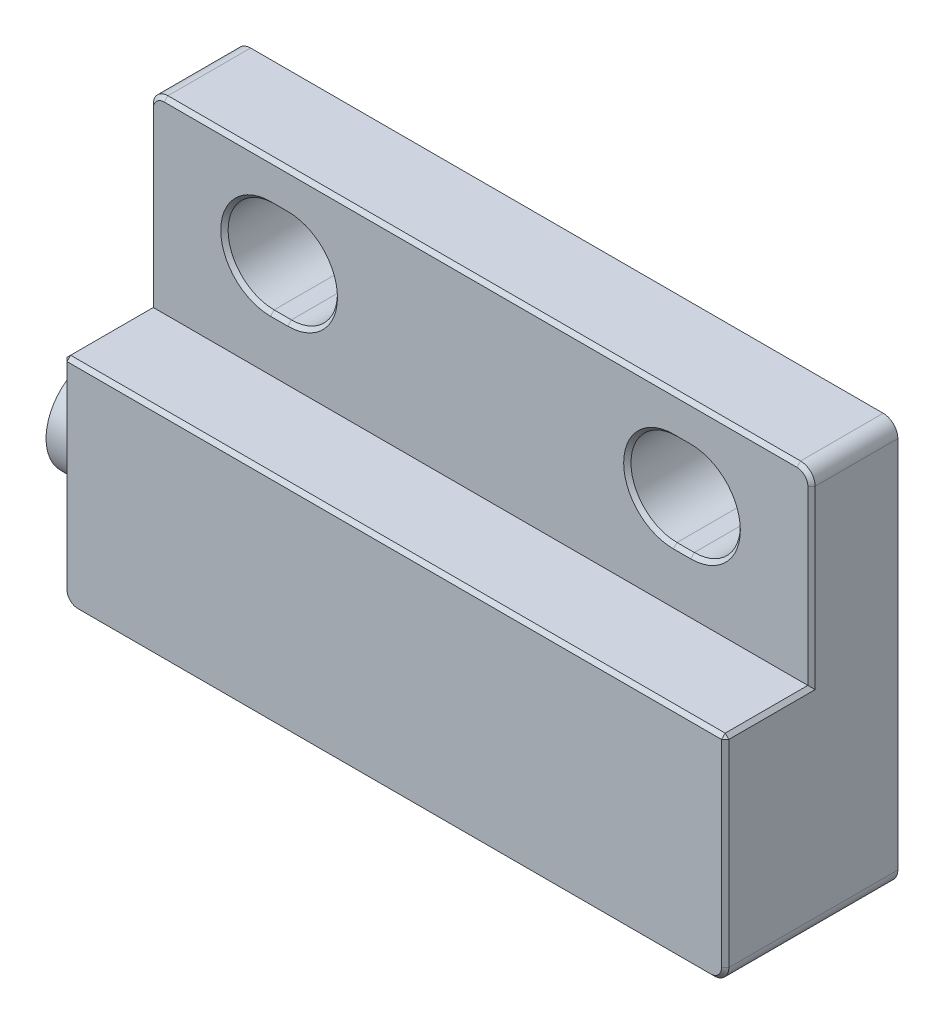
ISO-10303-21;
HEADER;
FILE_DESCRIPTION(('STEP AP214'),'2;1');
FILE_NAME('part.step','',(''),(''),'','','');
FILE_SCHEMA(('AUTOMOTIVE_DESIGN { 1 0 10303 214 1 1 1 1 }'));
ENDSEC;
DATA;
#1=APPLICATION_CONTEXT('core data for automotive mechanical design processes');
#2=APPLICATION_PROTOCOL_DEFINITION('international standard','automotive_design',2000,#1);
#3=PRODUCT_CONTEXT('',#1,'mechanical');
#4=PRODUCT('Part','Part','',(#3));
#5=PRODUCT_RELATED_PRODUCT_CATEGORY('part','',(#4));
#6=PRODUCT_DEFINITION_FORMATION('','',#4);
#7=PRODUCT_DEFINITION_CONTEXT('part definition',#1,'design');
#8=PRODUCT_DEFINITION('design','',#6,#7);
#9=PRODUCT_DEFINITION_SHAPE('','',#8);
#10=(LENGTH_UNIT() NAMED_UNIT(*) SI_UNIT(.MILLI.,.METRE.));
#11=(NAMED_UNIT(*) PLANE_ANGLE_UNIT() SI_UNIT($,.RADIAN.));
#12=(NAMED_UNIT(*) SI_UNIT($,.STERADIAN.) SOLID_ANGLE_UNIT());
#13=UNCERTAINTY_MEASURE_WITH_UNIT(LENGTH_MEASURE(1.E-05),#10,'distance_accuracy_value','');
#14=(GEOMETRIC_REPRESENTATION_CONTEXT(3) GLOBAL_UNCERTAINTY_ASSIGNED_CONTEXT((#13)) GLOBAL_UNIT_ASSIGNED_CONTEXT((#10,
#11,#12)) REPRESENTATION_CONTEXT('',''));
#15=CARTESIAN_POINT('',(0.,0.,0.));
#16=DIRECTION('',(0.,0.,1.));
#17=DIRECTION('',(1.,0.,0.));
#18=AXIS2_PLACEMENT_3D('',#15,#16,#17);
#19=CARTESIAN_POINT('',(0.,29.373,6.));
#20=DIRECTION('',(0.,0.707106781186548,0.707106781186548));
#21=DIRECTION('',(0.,-0.707106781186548,0.707106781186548));
#22=AXIS2_PLACEMENT_3D('',#19,#20,#21);
#23=PLANE('',#22);
#24=DIRECTION('',(0.,-0.707106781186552,0.707106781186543));
#25=VECTOR('',#24,1.);
#26=CARTESIAN_POINT('',(22.873,29.5,5.873));
#27=LINE('',#26,#25);
#28=CARTESIAN_POINT('',(22.873,29.5,5.873));
#29=VERTEX_POINT('',#28);
#30=CARTESIAN_POINT('',(22.873,29.373,6.));
#31=VERTEX_POINT('',#30);
#32=EDGE_CURVE('E519',#29,#31,#27,.T.);
#33=ORIENTED_EDGE('',*,*,#32,.F.);
#34=DIRECTION('',(1.,0.,0.));
#35=VECTOR('',#34,1.);
#36=CARTESIAN_POINT('',(0.,29.5,5.873));
#37=LINE('',#36,#35);
#38=CARTESIAN_POINT('',(0.126999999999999,29.5,5.873));
#39=VERTEX_POINT('',#38);
#40=EDGE_CURVE('E229',#29,#39,#37,.F.);
#41=ORIENTED_EDGE('',*,*,#40,.T.);
#42=DIRECTION('',(0.,0.707106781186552,-0.707106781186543));
#43=VECTOR('',#42,1.);
#44=CARTESIAN_POINT('',(0.126999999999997,29.373,6.));
#45=LINE('',#44,#43);
#46=CARTESIAN_POINT('',(0.126999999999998,29.373,6.));
#47=VERTEX_POINT('',#46);
#48=EDGE_CURVE('E119',#47,#39,#45,.T.);
#49=ORIENTED_EDGE('',*,*,#48,.F.);
#50=DIRECTION('',(1.,0.,0.));
#51=VECTOR('',#50,1.);
#52=CARTESIAN_POINT('',(0.,29.373,6.));
#53=LINE('',#52,#51);
#54=EDGE_CURVE('E226',#31,#47,#53,.F.);
#55=ORIENTED_EDGE('',*,*,#54,.F.);
#56=EDGE_LOOP('',(#33,#41,#49,#55));
#57=FACE_BOUND('',#56,.T.);
#58=ADVANCED_FACE('F15',(#57),#23,.T.);
#59=CARTESIAN_POINT('',(4.2,31.4,2.87299999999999));
#60=DIRECTION('',(0.,-0.707106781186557,-0.707106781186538));
#61=DIRECTION('',(0.,0.707106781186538,-0.707106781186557));
#62=AXIS2_PLACEMENT_3D('',#59,#60,#61);
#63=PLANE('',#62);
#64=DIRECTION('',(1.,0.,0.));
#65=VECTOR('',#64,1.);
#66=CARTESIAN_POINT('',(4.2,31.4,2.87299999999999));
#67=LINE('',#66,#65);
#68=CARTESIAN_POINT('',(4.8,31.4000000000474,2.87299999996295));
#69=VERTEX_POINT('',#68);
#70=CARTESIAN_POINT('',(4.2,31.4000000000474,2.87299999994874));
#71=VERTEX_POINT('',#70);
#72=EDGE_CURVE('E162',#69,#71,#67,.F.);
#73=ORIENTED_EDGE('',*,*,#72,.T.);
#74=DIRECTION('',(0.,0.707106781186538,-0.707106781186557));
#75=VECTOR('',#74,1.);
#76=CARTESIAN_POINT('',(4.19999999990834,-498962.8,498997.073000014));
#77=LINE('',#76,#75);
#78=CARTESIAN_POINT('',(4.2,31.273000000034,2.99999999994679));
#79=VERTEX_POINT('',#78);
#80=EDGE_CURVE('E494',#71,#79,#77,.F.);
#81=ORIENTED_EDGE('',*,*,#80,.T.);
#82=DIRECTION('',(-1.,0.,0.));
#83=VECTOR('',#82,1.);
#84=CARTESIAN_POINT('',(0.,31.273,3.));
#85=LINE('',#84,#83);
#86=CARTESIAN_POINT('',(4.8,31.2730000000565,2.99999999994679));
#87=VERTEX_POINT('',#86);
#88=EDGE_CURVE('E236',#79,#87,#85,.F.);
#89=ORIENTED_EDGE('',*,*,#88,.T.);
#90=DIRECTION('',(0.,0.707106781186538,-0.707106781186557));
#91=VECTOR('',#90,1.);
#92=CARTESIAN_POINT('',(4.79999999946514,-498962.2,498996.473000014));
#93=LINE('',#92,#91);
#94=EDGE_CURVE('E490',#87,#69,#93,.T.);
#95=ORIENTED_EDGE('',*,*,#94,.T.);
#96=EDGE_LOOP('',(#73,#81,#89,#95));
#97=FACE_BOUND('',#96,.T.);
#98=ADVANCED_FACE('F1093',(#97),#63,.F.);
#99=CARTESIAN_POINT('',(4.2,34.6,2.87299999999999));
#100=DIRECTION('',(0.,0.707106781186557,-0.707106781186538));
#101=DIRECTION('',(0.,0.707106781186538,0.707106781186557));
#102=AXIS2_PLACEMENT_3D('',#99,#100,#101);
#103=PLANE('',#102);
#104=DIRECTION('',(-1.,0.,0.));
#105=VECTOR('',#104,1.);
#106=CARTESIAN_POINT('',(4.2,34.6,2.87299999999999));
#107=LINE('',#106,#105);
#108=CARTESIAN_POINT('',(4.2,34.5999999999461,2.87299999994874));
#109=VERTEX_POINT('',#108);
#110=CARTESIAN_POINT('',(4.8,34.5999999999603,2.87299999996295));
#111=VERTEX_POINT('',#110);
#112=EDGE_CURVE('E161',#109,#111,#107,.F.);
#113=ORIENTED_EDGE('',*,*,#112,.T.);
#114=DIRECTION('',(0.,-0.707106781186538,-0.707106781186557));
#115=VECTOR('',#114,1.);
#116=CARTESIAN_POINT('',(4.80000000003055,499028.2,498996.473000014));
#117=LINE('',#116,#115);
#118=CARTESIAN_POINT('',(4.8,34.7269999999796,2.99999999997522));
#119=VERTEX_POINT('',#118);
#120=EDGE_CURVE('E218',#111,#119,#117,.F.);
#121=ORIENTED_EDGE('',*,*,#120,.T.);
#122=DIRECTION('',(-1.,0.,0.));
#123=VECTOR('',#122,1.);
#124=CARTESIAN_POINT('',(0.,34.727,3.));
#125=LINE('',#124,#123);
#126=CARTESIAN_POINT('',(4.2,34.7269999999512,2.99999999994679));
#127=VERTEX_POINT('',#126);
#128=EDGE_CURVE('E240',#119,#127,#125,.T.);
#129=ORIENTED_EDGE('',*,*,#128,.T.);
#130=DIRECTION('',(0.,-0.707106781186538,-0.707106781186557));
#131=VECTOR('',#130,1.);
#132=CARTESIAN_POINT('',(4.20000000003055,499028.8,498997.073000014));
#133=LINE('',#132,#131);
#134=EDGE_CURVE('E222',#127,#109,#133,.T.);
#135=ORIENTED_EDGE('',*,*,#134,.T.);
#136=EDGE_LOOP('',(#113,#121,#129,#135));
#137=FACE_BOUND('',#136,.T.);
#138=ADVANCED_FACE('F728',(#137),#103,.F.);
#139=CARTESIAN_POINT('',(18.2,31.4,2.87299999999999));
#140=DIRECTION('',(0.,-0.707106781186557,-0.707106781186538));
#141=DIRECTION('',(0.,0.707106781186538,-0.707106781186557));
#142=AXIS2_PLACEMENT_3D('',#139,#140,#141);
#143=PLANE('',#142);
#144=DIRECTION('',(1.,0.,0.));
#145=VECTOR('',#144,1.);
#146=CARTESIAN_POINT('',(18.2,31.4,2.87299999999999));
#147=LINE('',#146,#145);
#148=CARTESIAN_POINT('',(18.8,31.4000000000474,2.87299999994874));
#149=VERTEX_POINT('',#148);
#150=CARTESIAN_POINT('',(18.2,31.4000000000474,2.87299999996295));
#151=VERTEX_POINT('',#150);
#152=EDGE_CURVE('E454',#149,#151,#147,.F.);
#153=ORIENTED_EDGE('',*,*,#152,.T.);
#154=DIRECTION('',(0.,0.707106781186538,-0.707106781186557));
#155=VECTOR('',#154,1.);
#156=CARTESIAN_POINT('',(18.1999999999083,-498948.8,498983.073000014));
#157=LINE('',#156,#155);
#158=CARTESIAN_POINT('',(18.2,31.2730000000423,2.99999999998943));
#159=VERTEX_POINT('',#158);
#160=EDGE_CURVE('E462',#151,#159,#157,.F.);
#161=ORIENTED_EDGE('',*,*,#160,.T.);
#162=DIRECTION('',(-1.,0.,0.));
#163=VECTOR('',#162,1.);
#164=CARTESIAN_POINT('',(0.,31.273,3.));
#165=LINE('',#164,#163);
#166=CARTESIAN_POINT('',(18.8,31.2730000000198,2.99999999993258));
#167=VERTEX_POINT('',#166);
#168=EDGE_CURVE('E246',#159,#167,#165,.F.);
#169=ORIENTED_EDGE('',*,*,#168,.T.);
#170=DIRECTION('',(0.,0.707106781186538,-0.707106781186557));
#171=VECTOR('',#170,1.);
#172=CARTESIAN_POINT('',(18.7999999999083,-498948.2,498982.473000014));
#173=LINE('',#172,#171);
#174=EDGE_CURVE('E457',#167,#149,#173,.T.);
#175=ORIENTED_EDGE('',*,*,#174,.T.);
#176=EDGE_LOOP('',(#153,#161,#169,#175));
#177=FACE_BOUND('',#176,.T.);
#178=ADVANCED_FACE('F711',(#177),#143,.F.);
#179=CARTESIAN_POINT('',(18.2,34.6,2.87299999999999));
#180=DIRECTION('',(0.,0.707106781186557,-0.707106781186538));
#181=DIRECTION('',(0.,0.707106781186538,0.707106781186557));
#182=AXIS2_PLACEMENT_3D('',#179,#180,#181);
#183=PLANE('',#182);
#184=DIRECTION('',(-1.,0.,0.));
#185=VECTOR('',#184,1.);
#186=CARTESIAN_POINT('',(18.2,34.6,2.87299999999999));
#187=LINE('',#186,#185);
#188=CARTESIAN_POINT('',(18.2,34.5999999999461,2.87299999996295));
#189=VERTEX_POINT('',#188);
#190=CARTESIAN_POINT('',(18.8,34.5999999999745,2.87299999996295));
#191=VERTEX_POINT('',#190);
#192=EDGE_CURVE('E448',#189,#191,#187,.F.);
#193=ORIENTED_EDGE('',*,*,#192,.T.);
#194=DIRECTION('',(0.,-0.707106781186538,-0.707106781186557));
#195=VECTOR('',#194,1.);
#196=CARTESIAN_POINT('',(18.8000000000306,499014.2,498982.473000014));
#197=LINE('',#196,#195);
#198=CARTESIAN_POINT('',(18.8,34.7270000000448,3.00000000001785));
#199=VERTEX_POINT('',#198);
#200=EDGE_CURVE('E211',#191,#199,#197,.F.);
#201=ORIENTED_EDGE('',*,*,#200,.T.);
#202=DIRECTION('',(-1.,0.,0.));
#203=VECTOR('',#202,1.);
#204=CARTESIAN_POINT('',(0.,34.727,3.));
#205=LINE('',#204,#203);
#206=CARTESIAN_POINT('',(18.2,34.7269999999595,3.00000000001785));
#207=VERTEX_POINT('',#206);
#208=EDGE_CURVE('E254',#199,#207,#205,.T.);
#209=ORIENTED_EDGE('',*,*,#208,.T.);
#210=DIRECTION('',(0.,-0.707106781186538,-0.707106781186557));
#211=VECTOR('',#210,1.);
#212=CARTESIAN_POINT('',(18.2000000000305,499014.8,498983.073000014));
#213=LINE('',#212,#211);
#214=EDGE_CURVE('E215',#207,#189,#213,.T.);
#215=ORIENTED_EDGE('',*,*,#214,.T.);
#216=EDGE_LOOP('',(#193,#201,#209,#215));
#217=FACE_BOUND('',#216,.T.);
#218=ADVANCED_FACE('F717',(#217),#183,.F.);
#219=CARTESIAN_POINT('',(-2.,25.2928241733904,2.89227733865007));
#220=DIRECTION('',(-1.,0.,0.));
#221=DIRECTION('',(0.,0.,1.));
#222=AXIS2_PLACEMENT_3D('',#219,#220,#221);
#223=PLANE('',#222);
#224=CARTESIAN_POINT('',(-2.,25.2928241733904,2.89227733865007));
#225=DIRECTION('',(1.,0.,0.));
#226=DIRECTION('',(0.,0.,-1.));
#227=AXIS2_PLACEMENT_3D('',#224,#225,#226);
#228=CIRCLE('',#227,1.70637591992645);
#229=CARTESIAN_POINT('',(-2.,25.2928241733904,1.18590141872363));
#230=VERTEX_POINT('',#229);
#231=EDGE_CURVE('E205',#230,#230,#228,.T.);
#232=ORIENTED_EDGE('',*,*,#231,.F.);
#233=EDGE_LOOP('',(#232));
#234=FACE_BOUND('',#233,.T.);
#235=ADVANCED_FACE('F719',(#234),#223,.T.);
#236=CARTESIAN_POINT('',(0.126999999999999,29.5,5.873));
#237=DIRECTION('',(-0.577350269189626,0.577350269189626,0.577350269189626));
#238=DIRECTION('',(0.707106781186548,0.,0.707106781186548));
#239=AXIS2_PLACEMENT_3D('',#236,#237,#238);
#240=PLANE('',#239);
#241=ORIENTED_EDGE('',*,*,#48,.T.);
#242=DIRECTION('',(0.707106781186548,0.707106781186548,0.));
#243=VECTOR('',#242,1.);
#244=CARTESIAN_POINT('',(0.126999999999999,29.5,5.873));
#245=LINE('',#244,#243);
#246=CARTESIAN_POINT('',(0.,29.373,5.873));
#247=VERTEX_POINT('',#246);
#248=EDGE_CURVE('E265',#39,#247,#245,.F.);
#249=ORIENTED_EDGE('',*,*,#248,.T.);
#250=DIRECTION('',(0.707106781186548,0.,0.707106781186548));
#251=VECTOR('',#250,1.);
#252=CARTESIAN_POINT('',(0.126999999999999,29.373,6.));
#253=LINE('',#252,#251);
#254=EDGE_CURVE('E280',#47,#247,#253,.F.);
#255=ORIENTED_EDGE('',*,*,#254,.F.);
#256=EDGE_LOOP('',(#241,#249,#255));
#257=FACE_BOUND('',#256,.T.);
#258=ADVANCED_FACE('F602',(#257),#240,.T.);
#259=CARTESIAN_POINT('',(0.508,35.492,2.87300000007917));
#260=DIRECTION('',(0.,0.,-1.));
#261=DIRECTION('',(-1.,0.,0.));
#262=AXIS2_PLACEMENT_3D('',#259,#260,#261);
#263=CONICAL_SURFACE('',#262,0.507999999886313,0.785398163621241);
#264=DIRECTION('',(0.,0.707106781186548,-0.707106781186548));
#265=VECTOR('',#264,1.);
#266=CARTESIAN_POINT('',(0.508,35.873,3.));
#267=LINE('',#266,#265);
#268=CARTESIAN_POINT('',(0.508,35.8730000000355,2.99999999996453));
#269=VERTEX_POINT('',#268);
#270=CARTESIAN_POINT('',(0.508,36.,2.873));
#271=VERTEX_POINT('',#270);
#272=EDGE_CURVE('E204',#269,#271,#267,.T.);
#273=ORIENTED_EDGE('',*,*,#272,.T.);
#274=CARTESIAN_POINT('',(0.508,35.492,2.873));
#275=DIRECTION('',(0.,0.,-1.));
#276=DIRECTION('',(-1.,0.,0.));
#277=AXIS2_PLACEMENT_3D('',#274,#275,#276);
#278=CIRCLE('',#277,0.508);
#279=CARTESIAN_POINT('',(0.,35.492,2.873));
#280=VERTEX_POINT('',#279);
#281=EDGE_CURVE('E203',#280,#271,#278,.T.);
#282=ORIENTED_EDGE('',*,*,#281,.F.);
#283=DIRECTION('',(-0.707106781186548,0.,-0.707106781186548));
#284=VECTOR('',#283,1.);
#285=CARTESIAN_POINT('',(0.126999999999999,35.492,3.));
#286=LINE('',#285,#284);
#287=CARTESIAN_POINT('',(0.126999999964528,35.492,2.99999999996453));
#288=VERTEX_POINT('',#287);
#289=EDGE_CURVE('E109',#280,#288,#286,.F.);
#290=ORIENTED_EDGE('',*,*,#289,.T.);
#291=CARTESIAN_POINT('',(0.508,35.492,2.99999999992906));
#292=DIRECTION('',(0.,0.,-1.));
#293=DIRECTION('',(-1.,0.,0.));
#294=AXIS2_PLACEMENT_3D('',#291,#292,#293);
#295=CIRCLE('',#294,0.380999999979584);
#296=EDGE_CURVE('E18',#288,#269,#295,.T.);
#297=ORIENTED_EDGE('',*,*,#296,.T.);
#298=EDGE_LOOP('',(#273,#282,#290,#297));
#299=FACE_BOUND('',#298,.T.);
#300=ADVANCED_FACE('F829',(#299),#263,.T.);
#301=CARTESIAN_POINT('',(0.,36.,3.));
#302=DIRECTION('',(0.,0.,-1.));
#303=DIRECTION('',(-1.,0.,0.));
#304=AXIS2_PLACEMENT_3D('',#301,#302,#303);
#305=PLANE('',#304);
#306=DIRECTION('',(1.,0.,0.));
#307=VECTOR('',#306,1.);
#308=CARTESIAN_POINT('',(0.,35.873,3.));
#309=LINE('',#308,#307);
#310=CARTESIAN_POINT('',(22.492,35.8729999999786,3.00000000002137));
#311=VERTEX_POINT('',#310);
#312=EDGE_CURVE('E256',#311,#269,#309,.F.);
#313=ORIENTED_EDGE('',*,*,#312,.T.);
#314=ORIENTED_EDGE('',*,*,#296,.F.);
#315=DIRECTION('',(0.,1.,0.));
#316=VECTOR('',#315,1.);
#317=CARTESIAN_POINT('',(0.126999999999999,36.,3.));
#318=LINE('',#317,#316);
#319=CARTESIAN_POINT('',(0.126999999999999,29.5,3.));
#320=VERTEX_POINT('',#319);
#321=EDGE_CURVE('E271',#288,#320,#318,.F.);
#322=ORIENTED_EDGE('',*,*,#321,.T.);
#323=DIRECTION('',(1.,0.,0.));
#324=VECTOR('',#323,1.);
#325=CARTESIAN_POINT('',(0.,29.5,3.));
#326=LINE('',#325,#324);
#327=CARTESIAN_POINT('',(22.873,29.5,3.));
#328=VERTEX_POINT('',#327);
#329=EDGE_CURVE('E234',#320,#328,#326,.T.);
#330=ORIENTED_EDGE('',*,*,#329,.T.);
#331=DIRECTION('',(0.,1.,0.));
#332=VECTOR('',#331,1.);
#333=CARTESIAN_POINT('',(22.873,36.,3.));
#334=LINE('',#333,#332);
#335=CARTESIAN_POINT('',(22.8729999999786,35.492,3.00000000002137));
#336=VERTEX_POINT('',#335);
#337=EDGE_CURVE('E380',#328,#336,#334,.T.);
#338=ORIENTED_EDGE('',*,*,#337,.T.);
#339=CARTESIAN_POINT('',(22.492,35.492,3.00000000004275));
#340=DIRECTION('',(0.,0.,-1.));
#341=DIRECTION('',(-1.,0.,0.));
#342=AXIS2_PLACEMENT_3D('',#339,#340,#341);
#343=CIRCLE('',#342,0.381000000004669);
#344=EDGE_CURVE('E227',#311,#336,#343,.T.);
#345=ORIENTED_EDGE('',*,*,#344,.F.);
#346=EDGE_LOOP('',(#313,#314,#322,#330,#338,#345));
#347=FACE_BOUND('',#346,.T.);
#348=ORIENTED_EDGE('',*,*,#88,.F.);
#349=CARTESIAN_POINT('',(4.2,33.,2.9999999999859));
#350=DIRECTION('',(0.,0.,1.));
#351=DIRECTION('',(1.,0.,0.));
#352=AXIS2_PLACEMENT_3D('',#349,#350,#351);
#353=CIRCLE('',#352,1.72699999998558);
#354=EDGE_CURVE('E219',#79,#127,#353,.F.);
#355=ORIENTED_EDGE('',*,*,#354,.T.);
#356=ORIENTED_EDGE('',*,*,#128,.F.);
#357=CARTESIAN_POINT('',(4.8,33.,2.9999999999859));
#358=DIRECTION('',(0.,0.,1.));
#359=DIRECTION('',(1.,0.,0.));
#360=AXIS2_PLACEMENT_3D('',#357,#358,#359);
#361=CIRCLE('',#360,1.72699999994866);
#362=EDGE_CURVE('E216',#119,#87,#361,.F.);
#363=ORIENTED_EDGE('',*,*,#362,.T.);
#364=EDGE_LOOP('',(#348,#355,#356,#363));
#365=FACE_BOUND('',#364,.T.);
#366=ORIENTED_EDGE('',*,*,#168,.F.);
#367=CARTESIAN_POINT('',(18.2,33.,3.00000000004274));
#368=DIRECTION('',(0.,0.,1.));
#369=DIRECTION('',(0.,-1.,0.));
#370=AXIS2_PLACEMENT_3D('',#367,#368,#369);
#371=CIRCLE('',#370,1.72699999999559);
#372=EDGE_CURVE('E212',#159,#207,#371,.F.);
#373=ORIENTED_EDGE('',*,*,#372,.T.);
#374=ORIENTED_EDGE('',*,*,#208,.F.);
#375=CARTESIAN_POINT('',(18.8,33.,3.00000000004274));
#376=DIRECTION('',(0.,0.,1.));
#377=DIRECTION('',(0.,-1.,0.));
#378=AXIS2_PLACEMENT_3D('',#375,#376,#377);
#379=CIRCLE('',#378,1.72700000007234);
#380=EDGE_CURVE('E209',#199,#167,#379,.F.);
#381=ORIENTED_EDGE('',*,*,#380,.T.);
#382=EDGE_LOOP('',(#366,#373,#374,#381));
#383=FACE_BOUND('',#382,.T.);
#384=ADVANCED_FACE('F644',(#347,#365,#383),#305,.F.);
#385=CARTESIAN_POINT('',(22.492,35.492,2.87300000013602));
#386=DIRECTION('',(0.,0.,-1.));
#387=DIRECTION('',(-1.,0.,0.));
#388=AXIS2_PLACEMENT_3D('',#385,#386,#387);
#389=CONICAL_SURFACE('',#388,0.507999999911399,0.785398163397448);
#390=DIRECTION('',(-0.707106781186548,0.,0.707106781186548));
#391=VECTOR('',#390,1.);
#392=CARTESIAN_POINT('',(22.873,35.492,3.));
#393=LINE('',#392,#391);
#394=CARTESIAN_POINT('',(23.,35.492,2.873));
#395=VERTEX_POINT('',#394);
#396=EDGE_CURVE('E200',#336,#395,#393,.F.);
#397=ORIENTED_EDGE('',*,*,#396,.T.);
#398=CARTESIAN_POINT('',(22.492,35.492,2.873));
#399=DIRECTION('',(0.,0.,-1.));
#400=DIRECTION('',(-1.,0.,0.));
#401=AXIS2_PLACEMENT_3D('',#398,#399,#400);
#402=CIRCLE('',#401,0.508000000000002);
#403=CARTESIAN_POINT('',(22.492,36.,2.873));
#404=VERTEX_POINT('',#403);
#405=EDGE_CURVE('E199',#404,#395,#402,.T.);
#406=ORIENTED_EDGE('',*,*,#405,.F.);
#407=DIRECTION('',(0.,0.707106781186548,-0.707106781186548));
#408=VECTOR('',#407,1.);
#409=CARTESIAN_POINT('',(22.492,35.873,3.));
#410=LINE('',#409,#408);
#411=EDGE_CURVE('E258',#404,#311,#410,.F.);
#412=ORIENTED_EDGE('',*,*,#411,.T.);
#413=ORIENTED_EDGE('',*,*,#344,.T.);
#414=EDGE_LOOP('',(#397,#406,#412,#413));
#415=FACE_BOUND('',#414,.T.);
#416=ADVANCED_FACE('F824',(#415),#389,.T.);
#417=CARTESIAN_POINT('',(0.,29.5,6.));
#418=DIRECTION('',(0.,-1.,0.));
#419=DIRECTION('',(0.,0.,-1.));
#420=AXIS2_PLACEMENT_3D('',#417,#418,#419);
#421=PLANE('',#420);
#422=DIRECTION('',(0.,0.,1.));
#423=VECTOR('',#422,1.);
#424=CARTESIAN_POINT('',(0.126999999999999,29.5,6.));
#425=LINE('',#424,#423);
#426=EDGE_CURVE('E262',#320,#39,#425,.T.);
#427=ORIENTED_EDGE('',*,*,#426,.T.);
#428=ORIENTED_EDGE('',*,*,#40,.F.);
#429=DIRECTION('',(0.,0.,1.));
#430=VECTOR('',#429,1.);
#431=CARTESIAN_POINT('',(22.873,29.5,3.));
#432=LINE('',#431,#430);
#433=EDGE_CURVE('E390',#29,#328,#432,.F.);
#434=ORIENTED_EDGE('',*,*,#433,.T.);
#435=ORIENTED_EDGE('',*,*,#329,.F.);
#436=EDGE_LOOP('',(#427,#428,#434,#435));
#437=FACE_BOUND('',#436,.T.);
#438=ADVANCED_FACE('F593',(#437),#421,.F.);
#439=CARTESIAN_POINT('',(23.,29.373,5.873));
#440=DIRECTION('',(0.577350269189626,0.577350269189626,0.577350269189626));
#441=DIRECTION('',(0.707106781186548,0.,-0.707106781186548));
#442=AXIS2_PLACEMENT_3D('',#439,#440,#441);
#443=PLANE('',#442);
#444=DIRECTION('',(0.707106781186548,-0.707106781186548,0.));
#445=VECTOR('',#444,1.);
#446=CARTESIAN_POINT('',(23.,29.373,5.873));
#447=LINE('',#446,#445);
#448=CARTESIAN_POINT('',(23.,29.373,5.873));
#449=VERTEX_POINT('',#448);
#450=EDGE_CURVE('E349',#449,#29,#447,.F.);
#451=ORIENTED_EDGE('',*,*,#450,.T.);
#452=ORIENTED_EDGE('',*,*,#32,.T.);
#453=DIRECTION('',(0.707106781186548,0.,-0.707106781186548));
#454=VECTOR('',#453,1.);
#455=CARTESIAN_POINT('',(22.873,29.373,6.));
#456=LINE('',#455,#454);
#457=EDGE_CURVE('E359',#449,#31,#456,.F.);
#458=ORIENTED_EDGE('',*,*,#457,.F.);
#459=EDGE_LOOP('',(#451,#452,#458));
#460=FACE_BOUND('',#459,.T.);
#461=ADVANCED_FACE('F549',(#460),#443,.T.);
#462=CARTESIAN_POINT('',(0.,36.,6.));
#463=DIRECTION('',(0.,0.,1.));
#464=DIRECTION('',(1.,0.,0.));
#465=AXIS2_PLACEMENT_3D('',#462,#463,#464);
#466=PLANE('',#465);
#467=DIRECTION('',(1.,0.,0.));
#468=VECTOR('',#467,1.);
#469=CARTESIAN_POINT('',(0.,22.127,6.));
#470=LINE('',#469,#468);
#471=CARTESIAN_POINT('',(22.492,22.1269999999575,5.99999999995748));
#472=VERTEX_POINT('',#471);
#473=CARTESIAN_POINT('',(0.508,22.1269999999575,5.99999999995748));
#474=VERTEX_POINT('',#473);
#475=EDGE_CURVE('E196',#472,#474,#470,.F.);
#476=ORIENTED_EDGE('',*,*,#475,.F.);
#477=CARTESIAN_POINT('',(22.492,22.508,5.99999999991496));
#478=DIRECTION('',(0.,0.,-1.));
#479=DIRECTION('',(-1.,0.,0.));
#480=AXIS2_PLACEMENT_3D('',#477,#478,#479);
#481=CIRCLE('',#480,0.381000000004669);
#482=CARTESIAN_POINT('',(22.8730000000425,22.508,5.99999999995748));
#483=VERTEX_POINT('',#482);
#484=EDGE_CURVE('E225',#483,#472,#481,.T.);
#485=ORIENTED_EDGE('',*,*,#484,.F.);
#486=DIRECTION('',(0.,1.,0.));
#487=VECTOR('',#486,1.);
#488=CARTESIAN_POINT('',(22.873,36.,6.));
#489=LINE('',#488,#487);
#490=EDGE_CURVE('E514',#31,#483,#489,.F.);
#491=ORIENTED_EDGE('',*,*,#490,.F.);
#492=ORIENTED_EDGE('',*,*,#54,.T.);
#493=DIRECTION('',(0.,1.,0.));
#494=VECTOR('',#493,1.);
#495=CARTESIAN_POINT('',(0.126999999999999,36.,6.));
#496=LINE('',#495,#494);
#497=CARTESIAN_POINT('',(0.126999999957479,22.508,5.99999999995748));
#498=VERTEX_POINT('',#497);
#499=EDGE_CURVE('E277',#498,#47,#496,.T.);
#500=ORIENTED_EDGE('',*,*,#499,.F.);
#501=CARTESIAN_POINT('',(0.508,22.508,5.99999999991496));
#502=DIRECTION('',(0.,0.,-1.));
#503=DIRECTION('',(0.,1.,0.));
#504=AXIS2_PLACEMENT_3D('',#501,#502,#503);
#505=CIRCLE('',#504,0.380999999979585);
#506=EDGE_CURVE('E223',#474,#498,#505,.T.);
#507=ORIENTED_EDGE('',*,*,#506,.F.);
#508=EDGE_LOOP('',(#476,#485,#491,#492,#500,#507));
#509=FACE_BOUND('',#508,.T.);
#510=ADVANCED_FACE('F624',(#509),#466,.T.);
#511=CARTESIAN_POINT('',(22.492,22.508,5.87300000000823));
#512=DIRECTION('',(0.,0.,-1.));
#513=DIRECTION('',(-1.,0.,0.));
#514=AXIS2_PLACEMENT_3D('',#511,#512,#513);
#515=CONICAL_SURFACE('',#514,0.507999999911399,0.785398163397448);
#516=DIRECTION('',(0.707106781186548,0.,-0.707106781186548));
#517=VECTOR('',#516,1.);
#518=CARTESIAN_POINT('',(22.873,22.508,6.));
#519=LINE('',#518,#517);
#520=CARTESIAN_POINT('',(23.,22.508,5.873));
#521=VERTEX_POINT('',#520);
#522=EDGE_CURVE('E356',#483,#521,#519,.T.);
#523=ORIENTED_EDGE('',*,*,#522,.F.);
#524=ORIENTED_EDGE('',*,*,#484,.T.);
#525=DIRECTION('',(0.,-0.707106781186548,-0.707106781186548));
#526=VECTOR('',#525,1.);
#527=CARTESIAN_POINT('',(22.492,22.127,6.));
#528=LINE('',#527,#526);
#529=CARTESIAN_POINT('',(22.492,22.,5.873));
#530=VERTEX_POINT('',#529);
#531=EDGE_CURVE('E348',#530,#472,#528,.F.);
#532=ORIENTED_EDGE('',*,*,#531,.F.);
#533=CARTESIAN_POINT('',(22.492,22.508,5.873));
#534=DIRECTION('',(0.,0.,-1.));
#535=DIRECTION('',(-1.,0.,0.));
#536=AXIS2_PLACEMENT_3D('',#533,#534,#535);
#537=CIRCLE('',#536,0.508000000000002);
#538=EDGE_CURVE('E193',#521,#530,#537,.T.);
#539=ORIENTED_EDGE('',*,*,#538,.F.);
#540=EDGE_LOOP('',(#523,#524,#532,#539));
#541=FACE_BOUND('',#540,.T.);
#542=ADVANCED_FACE('F628',(#541),#515,.T.);
#543=CARTESIAN_POINT('',(0.508,22.508,5.87299999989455));
#544=DIRECTION('',(0.,0.,-1.));
#545=DIRECTION('',(0.,1.,0.));
#546=AXIS2_PLACEMENT_3D('',#543,#544,#545);
#547=CONICAL_SURFACE('',#546,0.508,0.785398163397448);
#548=DIRECTION('',(0.707106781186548,0.,0.707106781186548));
#549=VECTOR('',#548,1.);
#550=CARTESIAN_POINT('',(0.126999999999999,22.508,6.));
#551=LINE('',#550,#549);
#552=CARTESIAN_POINT('',(0.,22.508,5.873));
#553=VERTEX_POINT('',#552);
#554=EDGE_CURVE('E208',#553,#498,#551,.T.);
#555=ORIENTED_EDGE('',*,*,#554,.F.);
#556=CARTESIAN_POINT('',(0.508,22.508,5.873));
#557=DIRECTION('',(0.,0.,-1.));
#558=DIRECTION('',(-1.,0.,0.));
#559=AXIS2_PLACEMENT_3D('',#556,#557,#558);
#560=CIRCLE('',#559,0.508);
#561=CARTESIAN_POINT('',(0.508,22.,5.873));
#562=VERTEX_POINT('',#561);
#563=EDGE_CURVE('E192',#562,#553,#560,.T.);
#564=ORIENTED_EDGE('',*,*,#563,.F.);
#565=DIRECTION('',(0.,-0.707106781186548,-0.707106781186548));
#566=VECTOR('',#565,1.);
#567=CARTESIAN_POINT('',(0.508,22.127,6.));
#568=LINE('',#567,#566);
#569=EDGE_CURVE('E345',#474,#562,#568,.T.);
#570=ORIENTED_EDGE('',*,*,#569,.F.);
#571=ORIENTED_EDGE('',*,*,#506,.T.);
#572=EDGE_LOOP('',(#555,#564,#570,#571));
#573=FACE_BOUND('',#572,.T.);
#574=ADVANCED_FACE('F618',(#573),#547,.T.);
#575=CARTESIAN_POINT('',(4.2,33.,2.99999999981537));
#576=DIRECTION('',(0.,0.,1.));
#577=DIRECTION('',(1.,0.,0.));
#578=AXIS2_PLACEMENT_3D('',#575,#576,#577);
#579=CONICAL_SURFACE('',#578,1.72699999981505,0.785398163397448);
#580=CARTESIAN_POINT('',(4.2,33.,2.87299999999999));
#581=DIRECTION('',(0.,0.,1.));
#582=DIRECTION('',(1.,0.,0.));
#583=AXIS2_PLACEMENT_3D('',#580,#581,#582);
#584=CIRCLE('',#583,1.6);
#585=EDGE_CURVE('E170',#71,#109,#584,.F.);
#586=ORIENTED_EDGE('',*,*,#585,.T.);
#587=ORIENTED_EDGE('',*,*,#134,.F.);
#588=ORIENTED_EDGE('',*,*,#354,.F.);
#589=ORIENTED_EDGE('',*,*,#80,.F.);
#590=EDGE_LOOP('',(#586,#587,#588,#589));
#591=FACE_BOUND('',#590,.T.);
#592=ADVANCED_FACE('F810',(#591),#579,.F.);
#593=CARTESIAN_POINT('',(4.2,31.4,0.));
#594=DIRECTION('',(0.,-1.,0.));
#595=DIRECTION('',(0.,0.,-1.));
#596=AXIS2_PLACEMENT_3D('',#593,#594,#595);
#597=PLANE('',#596);
#598=DIRECTION('',(1.,0.,0.));
#599=VECTOR('',#598,1.);
#600=CARTESIAN_POINT('',(4.2,31.4,0.));
#601=LINE('',#600,#599);
#602=CARTESIAN_POINT('',(4.2,31.4,0.));
#603=VERTEX_POINT('',#602);
#604=CARTESIAN_POINT('',(4.8,31.4,0.));
#605=VERTEX_POINT('',#604);
#606=EDGE_CURVE('E150',#603,#605,#601,.T.);
#607=ORIENTED_EDGE('',*,*,#606,.F.);
#608=DIRECTION('',(0.,0.,1.));
#609=VECTOR('',#608,1.);
#610=CARTESIAN_POINT('',(4.2,31.4,0.));
#611=LINE('',#610,#609);
#612=EDGE_CURVE('E154',#603,#71,#611,.T.);
#613=ORIENTED_EDGE('',*,*,#612,.T.);
#614=ORIENTED_EDGE('',*,*,#72,.F.);
#615=DIRECTION('',(0.,0.,1.));
#616=VECTOR('',#615,1.);
#617=CARTESIAN_POINT('',(4.8,31.4,0.));
#618=LINE('',#617,#616);
#619=EDGE_CURVE('E157',#69,#605,#618,.F.);
#620=ORIENTED_EDGE('',*,*,#619,.T.);
#621=EDGE_LOOP('',(#607,#613,#614,#620));
#622=FACE_BOUND('',#621,.T.);
#623=ADVANCED_FACE('F152',(#622),#597,.F.);
#624=CARTESIAN_POINT('',(4.2,34.6,0.));
#625=DIRECTION('',(0.,1.,0.));
#626=DIRECTION('',(-1.,0.,0.));
#627=AXIS2_PLACEMENT_3D('',#624,#625,#626);
#628=PLANE('',#627);
#629=DIRECTION('',(-1.,0.,0.));
#630=VECTOR('',#629,1.);
#631=CARTESIAN_POINT('',(4.2,34.6,0.));
#632=LINE('',#631,#630);
#633=CARTESIAN_POINT('',(4.8,34.6,0.));
#634=VERTEX_POINT('',#633);
#635=CARTESIAN_POINT('',(4.2,34.6,0.));
#636=VERTEX_POINT('',#635);
#637=EDGE_CURVE('E175',#634,#636,#632,.T.);
#638=ORIENTED_EDGE('',*,*,#637,.F.);
#639=DIRECTION('',(0.,0.,1.));
#640=VECTOR('',#639,1.);
#641=CARTESIAN_POINT('',(4.8,34.6,0.));
#642=LINE('',#641,#640);
#643=EDGE_CURVE('E317',#634,#111,#642,.T.);
#644=ORIENTED_EDGE('',*,*,#643,.T.);
#645=ORIENTED_EDGE('',*,*,#112,.F.);
#646=DIRECTION('',(0.,0.,1.));
#647=VECTOR('',#646,1.);
#648=CARTESIAN_POINT('',(4.2,34.6,0.));
#649=LINE('',#648,#647);
#650=EDGE_CURVE('E171',#109,#636,#649,.F.);
#651=ORIENTED_EDGE('',*,*,#650,.T.);
#652=EDGE_LOOP('',(#638,#644,#645,#651));
#653=FACE_BOUND('',#652,.T.);
#654=ADVANCED_FACE('F803',(#653),#628,.F.);
#655=CARTESIAN_POINT('',(4.8,33.,2.99999999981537));
#656=DIRECTION('',(0.,0.,1.));
#657=DIRECTION('',(1.,0.,0.));
#658=AXIS2_PLACEMENT_3D('',#655,#656,#657);
#659=CONICAL_SURFACE('',#658,1.72699999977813,0.785398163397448);
#660=CARTESIAN_POINT('',(4.8,33.,2.87299999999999));
#661=DIRECTION('',(0.,0.,1.));
#662=DIRECTION('',(1.,0.,0.));
#663=AXIS2_PLACEMENT_3D('',#660,#661,#662);
#664=CIRCLE('',#663,1.6);
#665=EDGE_CURVE('E320',#111,#69,#664,.F.);
#666=ORIENTED_EDGE('',*,*,#665,.T.);
#667=ORIENTED_EDGE('',*,*,#94,.F.);
#668=ORIENTED_EDGE('',*,*,#362,.F.);
#669=ORIENTED_EDGE('',*,*,#120,.F.);
#670=EDGE_LOOP('',(#666,#667,#668,#669));
#671=FACE_BOUND('',#670,.T.);
#672=ADVANCED_FACE('F800',(#671),#659,.F.);
#673=CARTESIAN_POINT('',(18.2,33.,2.99999999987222));
#674=DIRECTION('',(0.,0.,1.));
#675=DIRECTION('',(0.,-1.,0.));
#676=AXIS2_PLACEMENT_3D('',#673,#674,#675);
#677=CONICAL_SURFACE('',#676,1.72699999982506,0.785398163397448);
#678=CARTESIAN_POINT('',(18.2,33.,2.87299999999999));
#679=DIRECTION('',(0.,0.,1.));
#680=DIRECTION('',(1.,0.,0.));
#681=AXIS2_PLACEMENT_3D('',#678,#679,#680);
#682=CIRCLE('',#681,1.6);
#683=EDGE_CURVE('E304',#151,#189,#682,.F.);
#684=ORIENTED_EDGE('',*,*,#683,.T.);
#685=ORIENTED_EDGE('',*,*,#214,.F.);
#686=ORIENTED_EDGE('',*,*,#372,.F.);
#687=ORIENTED_EDGE('',*,*,#160,.F.);
#688=EDGE_LOOP('',(#684,#685,#686,#687));
#689=FACE_BOUND('',#688,.T.);
#690=ADVANCED_FACE('F714',(#689),#677,.F.);
#691=CARTESIAN_POINT('',(18.2,31.4,0.));
#692=DIRECTION('',(0.,-1.,0.));
#693=DIRECTION('',(0.,0.,-1.));
#694=AXIS2_PLACEMENT_3D('',#691,#692,#693);
#695=PLANE('',#694);
#696=DIRECTION('',(1.,0.,0.));
#697=VECTOR('',#696,1.);
#698=CARTESIAN_POINT('',(18.2,31.4,0.));
#699=LINE('',#698,#697);
#700=CARTESIAN_POINT('',(18.2,31.4,0.));
#701=VERTEX_POINT('',#700);
#702=CARTESIAN_POINT('',(18.8,31.4,0.));
#703=VERTEX_POINT('',#702);
#704=EDGE_CURVE('E288',#701,#703,#699,.T.);
#705=ORIENTED_EDGE('',*,*,#704,.F.);
#706=DIRECTION('',(0.,0.,1.));
#707=VECTOR('',#706,1.);
#708=CARTESIAN_POINT('',(18.2,31.4,0.));
#709=LINE('',#708,#707);
#710=EDGE_CURVE('E301',#701,#151,#709,.T.);
#711=ORIENTED_EDGE('',*,*,#710,.T.);
#712=ORIENTED_EDGE('',*,*,#152,.F.);
#713=DIRECTION('',(0.,0.,1.));
#714=VECTOR('',#713,1.);
#715=CARTESIAN_POINT('',(18.8,31.4,0.));
#716=LINE('',#715,#714);
#717=EDGE_CURVE('E307',#149,#703,#716,.F.);
#718=ORIENTED_EDGE('',*,*,#717,.T.);
#719=EDGE_LOOP('',(#705,#711,#712,#718));
#720=FACE_BOUND('',#719,.T.);
#721=ADVANCED_FACE('F708',(#720),#695,.F.);
#722=CARTESIAN_POINT('',(18.2,34.6,0.));
#723=DIRECTION('',(0.,1.,0.));
#724=DIRECTION('',(-1.,0.,0.));
#725=AXIS2_PLACEMENT_3D('',#722,#723,#724);
#726=PLANE('',#725);
#727=DIRECTION('',(-1.,0.,0.));
#728=VECTOR('',#727,1.);
#729=CARTESIAN_POINT('',(18.2,34.6,0.));
#730=LINE('',#729,#728);
#731=CARTESIAN_POINT('',(18.8,34.6,0.));
#732=VERTEX_POINT('',#731);
#733=CARTESIAN_POINT('',(18.2,34.6,0.));
#734=VERTEX_POINT('',#733);
#735=EDGE_CURVE('E291',#732,#734,#730,.T.);
#736=ORIENTED_EDGE('',*,*,#735,.F.);
#737=DIRECTION('',(0.,0.,1.));
#738=VECTOR('',#737,1.);
#739=CARTESIAN_POINT('',(18.8,34.6,0.));
#740=LINE('',#739,#738);
#741=EDGE_CURVE('E309',#732,#191,#740,.T.);
#742=ORIENTED_EDGE('',*,*,#741,.T.);
#743=ORIENTED_EDGE('',*,*,#192,.F.);
#744=DIRECTION('',(0.,0.,1.));
#745=VECTOR('',#744,1.);
#746=CARTESIAN_POINT('',(18.2,34.6,0.));
#747=LINE('',#746,#745);
#748=EDGE_CURVE('E299',#189,#734,#747,.F.);
#749=ORIENTED_EDGE('',*,*,#748,.T.);
#750=EDGE_LOOP('',(#736,#742,#743,#749));
#751=FACE_BOUND('',#750,.T.);
#752=ADVANCED_FACE('F696',(#751),#726,.F.);
#753=CARTESIAN_POINT('',(18.8,33.,2.99999999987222));
#754=DIRECTION('',(0.,0.,1.));
#755=DIRECTION('',(0.,-1.,0.));
#756=AXIS2_PLACEMENT_3D('',#753,#754,#755);
#757=CONICAL_SURFACE('',#756,1.72699999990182,0.785398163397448);
#758=CARTESIAN_POINT('',(18.8,33.,2.87299999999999));
#759=DIRECTION('',(0.,0.,1.));
#760=DIRECTION('',(1.,0.,0.));
#761=AXIS2_PLACEMENT_3D('',#758,#759,#760);
#762=CIRCLE('',#761,1.6);
#763=EDGE_CURVE('E190',#191,#149,#762,.F.);
#764=ORIENTED_EDGE('',*,*,#763,.T.);
#765=ORIENTED_EDGE('',*,*,#174,.F.);
#766=ORIENTED_EDGE('',*,*,#380,.F.);
#767=ORIENTED_EDGE('',*,*,#200,.F.);
#768=EDGE_LOOP('',(#764,#765,#766,#767));
#769=FACE_BOUND('',#768,.T.);
#770=ADVANCED_FACE('F702',(#769),#757,.F.);
#771=CARTESIAN_POINT('',(-2.,25.2928241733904,2.89227733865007));
#772=DIRECTION('',(1.,0.,0.));
#773=DIRECTION('',(0.,0.,-1.));
#774=AXIS2_PLACEMENT_3D('',#771,#772,#773);
#775=CYLINDRICAL_SURFACE('',#774,1.70637591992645);
#776=ORIENTED_EDGE('',*,*,#231,.T.);
#777=EDGE_LOOP('',(#776));
#778=FACE_BOUND('',#777,.T.);
#779=CARTESIAN_POINT('',(0.,25.2928241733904,2.89227733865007));
#780=DIRECTION('',(1.,0.,0.));
#781=DIRECTION('',(0.,0.,-1.));
#782=AXIS2_PLACEMENT_3D('',#779,#780,#781);
#783=CIRCLE('',#782,1.70637591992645);
#784=CARTESIAN_POINT('',(0.,25.2928241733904,1.18590141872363));
#785=VERTEX_POINT('',#784);
#786=EDGE_CURVE('E186',#785,#785,#783,.F.);
#787=ORIENTED_EDGE('',*,*,#786,.T.);
#788=EDGE_LOOP('',(#787));
#789=FACE_BOUND('',#788,.T.);
#790=ADVANCED_FACE('F788',(#778,#789),#775,.T.);
#791=CARTESIAN_POINT('',(0.126999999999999,36.,6.));
#792=DIRECTION('',(-0.707106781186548,0.,0.707106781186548));
#793=DIRECTION('',(0.707106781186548,0.,0.707106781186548));
#794=AXIS2_PLACEMENT_3D('',#791,#792,#793);
#795=PLANE('',#794);
#796=ORIENTED_EDGE('',*,*,#254,.T.);
#797=DIRECTION('',(0.,1.,0.));
#798=VECTOR('',#797,1.);
#799=CARTESIAN_POINT('',(0.,36.,5.873));
#800=LINE('',#799,#798);
#801=EDGE_CURVE('E189',#247,#553,#800,.F.);
#802=ORIENTED_EDGE('',*,*,#801,.T.);
#803=ORIENTED_EDGE('',*,*,#554,.T.);
#804=ORIENTED_EDGE('',*,*,#499,.T.);
#805=EDGE_LOOP('',(#796,#802,#803,#804));
#806=FACE_BOUND('',#805,.T.);
#807=ADVANCED_FACE('F613',(#806),#795,.T.);
#808=CARTESIAN_POINT('',(0.126999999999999,36.,3.));
#809=DIRECTION('',(0.707106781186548,0.,-0.707106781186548));
#810=DIRECTION('',(-0.707106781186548,0.,-0.707106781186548));
#811=AXIS2_PLACEMENT_3D('',#808,#809,#810);
#812=PLANE('',#811);
#813=ORIENTED_EDGE('',*,*,#321,.F.);
#814=ORIENTED_EDGE('',*,*,#289,.F.);
#815=DIRECTION('',(0.,1.,0.));
#816=VECTOR('',#815,1.);
#817=CARTESIAN_POINT('',(0.,36.,2.873));
#818=LINE('',#817,#816);
#819=CARTESIAN_POINT('',(0.,29.373,2.873));
#820=VERTEX_POINT('',#819);
#821=EDGE_CURVE('E413',#280,#820,#818,.F.);
#822=ORIENTED_EDGE('',*,*,#821,.T.);
#823=DIRECTION('',(0.577350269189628,0.577350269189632,0.577350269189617));
#824=VECTOR('',#823,1.);
#825=CARTESIAN_POINT('',(0.,29.373,2.873));
#826=LINE('',#825,#824);
#827=EDGE_CURVE('E266',#820,#320,#826,.T.);
#828=ORIENTED_EDGE('',*,*,#827,.T.);
#829=EDGE_LOOP('',(#813,#814,#822,#828));
#830=FACE_BOUND('',#829,.T.);
#831=ADVANCED_FACE('F648',(#830),#812,.F.);
#832=CARTESIAN_POINT('',(0.126999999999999,29.5,6.));
#833=DIRECTION('',(0.707106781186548,-0.707106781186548,0.));
#834=DIRECTION('',(0.707106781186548,0.707106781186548,0.));
#835=AXIS2_PLACEMENT_3D('',#832,#833,#834);
#836=PLANE('',#835);
#837=ORIENTED_EDGE('',*,*,#426,.F.);
#838=ORIENTED_EDGE('',*,*,#827,.F.);
#839=DIRECTION('',(0.,0.,-1.));
#840=VECTOR('',#839,1.);
#841=CARTESIAN_POINT('',(0.,29.373,3.));
#842=LINE('',#841,#840);
#843=EDGE_CURVE('E397',#820,#247,#842,.F.);
#844=ORIENTED_EDGE('',*,*,#843,.T.);
#845=ORIENTED_EDGE('',*,*,#248,.F.);
#846=EDGE_LOOP('',(#837,#838,#844,#845));
#847=FACE_BOUND('',#846,.T.);
#848=ADVANCED_FACE('F603',(#847),#836,.F.);
#849=CARTESIAN_POINT('',(0.,35.873,3.));
#850=DIRECTION('',(0.,-0.707106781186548,-0.707106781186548));
#851=DIRECTION('',(0.,0.707106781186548,-0.707106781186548));
#852=AXIS2_PLACEMENT_3D('',#849,#850,#851);
#853=PLANE('',#852);
#854=ORIENTED_EDGE('',*,*,#312,.F.);
#855=ORIENTED_EDGE('',*,*,#411,.F.);
#856=DIRECTION('',(1.,0.,0.));
#857=VECTOR('',#856,1.);
#858=CARTESIAN_POINT('',(0.,36.,2.873));
#859=LINE('',#858,#857);
#860=EDGE_CURVE('E393',#404,#271,#859,.F.);
#861=ORIENTED_EDGE('',*,*,#860,.T.);
#862=ORIENTED_EDGE('',*,*,#272,.F.);
#863=EDGE_LOOP('',(#854,#855,#861,#862));
#864=FACE_BOUND('',#863,.T.);
#865=ADVANCED_FACE('F778',(#864),#853,.F.);
#866=CARTESIAN_POINT('',(0.508,35.492,3.));
#867=DIRECTION('',(0.,0.,-1.));
#868=DIRECTION('',(-1.,0.,0.));
#869=AXIS2_PLACEMENT_3D('',#866,#867,#868);
#870=CYLINDRICAL_SURFACE('',#869,0.508);
#871=DIRECTION('',(0.,0.,-1.));
#872=VECTOR('',#871,1.);
#873=CARTESIAN_POINT('',(0.,35.492,3.));
#874=LINE('',#873,#872);
#875=CARTESIAN_POINT('',(0.,35.492,0.));
#876=VERTEX_POINT('',#875);
#877=EDGE_CURVE('E416',#876,#280,#874,.F.);
#878=ORIENTED_EDGE('',*,*,#877,.T.);
#879=ORIENTED_EDGE('',*,*,#281,.T.);
#880=DIRECTION('',(0.,0.,-1.));
#881=VECTOR('',#880,1.);
#882=CARTESIAN_POINT('',(0.508,36.,3.));
#883=LINE('',#882,#881);
#884=CARTESIAN_POINT('',(0.508,36.,0.));
#885=VERTEX_POINT('',#884);
#886=EDGE_CURVE('E396',#271,#885,#883,.T.);
#887=ORIENTED_EDGE('',*,*,#886,.T.);
#888=CARTESIAN_POINT('',(0.508,35.492,0.));
#889=DIRECTION('',(0.,0.,-1.));
#890=DIRECTION('',(-1.,0.,0.));
#891=AXIS2_PLACEMENT_3D('',#888,#889,#890);
#892=CIRCLE('',#891,0.508);
#893=EDGE_CURVE('E201',#885,#876,#892,.F.);
#894=ORIENTED_EDGE('',*,*,#893,.T.);
#895=EDGE_LOOP('',(#878,#879,#887,#894));
#896=FACE_BOUND('',#895,.T.);
#897=ADVANCED_FACE('F775',(#896),#870,.T.);
#898=CARTESIAN_POINT('',(22.873,36.,3.));
#899=DIRECTION('',(-0.707106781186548,0.,-0.707106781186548));
#900=DIRECTION('',(-0.707106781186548,0.,0.707106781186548));
#901=AXIS2_PLACEMENT_3D('',#898,#899,#900);
#902=PLANE('',#901);
#903=ORIENTED_EDGE('',*,*,#337,.F.);
#904=DIRECTION('',(0.577350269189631,-0.577350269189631,-0.577350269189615));
#905=VECTOR('',#904,1.);
#906=CARTESIAN_POINT('',(22.873,29.5,3.));
#907=LINE('',#906,#905);
#908=CARTESIAN_POINT('',(23.,29.373,2.873));
#909=VERTEX_POINT('',#908);
#910=EDGE_CURVE('E387',#328,#909,#907,.T.);
#911=ORIENTED_EDGE('',*,*,#910,.T.);
#912=DIRECTION('',(0.,1.,0.));
#913=VECTOR('',#912,1.);
#914=CARTESIAN_POINT('',(23.,36.,2.873));
#915=LINE('',#914,#913);
#916=EDGE_CURVE('E372',#909,#395,#915,.T.);
#917=ORIENTED_EDGE('',*,*,#916,.T.);
#918=ORIENTED_EDGE('',*,*,#396,.F.);
#919=EDGE_LOOP('',(#903,#911,#917,#918));
#920=FACE_BOUND('',#919,.T.);
#921=ADVANCED_FACE('F642',(#920),#902,.F.);
#922=CARTESIAN_POINT('',(22.492,35.492,3.));
#923=DIRECTION('',(0.,0.,-1.));
#924=DIRECTION('',(-1.,0.,0.));
#925=AXIS2_PLACEMENT_3D('',#922,#923,#924);
#926=CYLINDRICAL_SURFACE('',#925,0.508000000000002);
#927=DIRECTION('',(0.,0.,-1.));
#928=VECTOR('',#927,1.);
#929=CARTESIAN_POINT('',(22.492,36.,3.));
#930=LINE('',#929,#928);
#931=CARTESIAN_POINT('',(22.492,36.,0.));
#932=VERTEX_POINT('',#931);
#933=EDGE_CURVE('E376',#932,#404,#930,.F.);
#934=ORIENTED_EDGE('',*,*,#933,.T.);
#935=ORIENTED_EDGE('',*,*,#405,.T.);
#936=DIRECTION('',(0.,0.,1.));
#937=VECTOR('',#936,1.);
#938=CARTESIAN_POINT('',(23.,35.492,3.));
#939=LINE('',#938,#937);
#940=CARTESIAN_POINT('',(23.,35.492,0.));
#941=VERTEX_POINT('',#940);
#942=EDGE_CURVE('E375',#395,#941,#939,.F.);
#943=ORIENTED_EDGE('',*,*,#942,.T.);
#944=CARTESIAN_POINT('',(22.492,35.492,0.));
#945=DIRECTION('',(0.,0.,-1.));
#946=DIRECTION('',(-1.,0.,0.));
#947=AXIS2_PLACEMENT_3D('',#944,#945,#946);
#948=CIRCLE('',#947,0.508000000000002);
#949=EDGE_CURVE('E197',#941,#932,#948,.F.);
#950=ORIENTED_EDGE('',*,*,#949,.T.);
#951=EDGE_LOOP('',(#934,#935,#943,#950));
#952=FACE_BOUND('',#951,.T.);
#953=ADVANCED_FACE('F769',(#952),#926,.T.);
#954=CARTESIAN_POINT('',(22.873,36.,6.));
#955=DIRECTION('',(0.707106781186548,0.,0.707106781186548));
#956=DIRECTION('',(0.707106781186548,0.,-0.707106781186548));
#957=AXIS2_PLACEMENT_3D('',#954,#955,#956);
#958=PLANE('',#957);
#959=ORIENTED_EDGE('',*,*,#457,.T.);
#960=ORIENTED_EDGE('',*,*,#490,.T.);
#961=ORIENTED_EDGE('',*,*,#522,.T.);
#962=DIRECTION('',(0.,1.,0.));
#963=VECTOR('',#962,1.);
#964=CARTESIAN_POINT('',(23.,36.,5.873));
#965=LINE('',#964,#963);
#966=EDGE_CURVE('E362',#521,#449,#965,.T.);
#967=ORIENTED_EDGE('',*,*,#966,.T.);
#968=EDGE_LOOP('',(#959,#960,#961,#967));
#969=FACE_BOUND('',#968,.T.);
#970=ADVANCED_FACE('F541',(#969),#958,.T.);
#971=CARTESIAN_POINT('',(23.,29.373,3.));
#972=DIRECTION('',(-0.707106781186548,-0.707106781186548,0.));
#973=DIRECTION('',(0.707106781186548,-0.707106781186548,0.));
#974=AXIS2_PLACEMENT_3D('',#971,#972,#973);
#975=PLANE('',#974);
#976=DIRECTION('',(0.,0.,1.));
#977=VECTOR('',#976,1.);
#978=CARTESIAN_POINT('',(23.,29.373,3.));
#979=LINE('',#978,#977);
#980=EDGE_CURVE('E338',#449,#909,#979,.F.);
#981=ORIENTED_EDGE('',*,*,#980,.T.);
#982=ORIENTED_EDGE('',*,*,#910,.F.);
#983=ORIENTED_EDGE('',*,*,#433,.F.);
#984=ORIENTED_EDGE('',*,*,#450,.F.);
#985=EDGE_LOOP('',(#981,#982,#983,#984));
#986=FACE_BOUND('',#985,.T.);
#987=ADVANCED_FACE('F640',(#986),#975,.F.);
#988=CARTESIAN_POINT('',(0.,22.127,6.));
#989=DIRECTION('',(0.,-0.707106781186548,0.707106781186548));
#990=DIRECTION('',(0.,-0.707106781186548,-0.707106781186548));
#991=AXIS2_PLACEMENT_3D('',#988,#989,#990);
#992=PLANE('',#991);
#993=ORIENTED_EDGE('',*,*,#531,.T.);
#994=ORIENTED_EDGE('',*,*,#475,.T.);
#995=ORIENTED_EDGE('',*,*,#569,.T.);
#996=DIRECTION('',(1.,0.,0.));
#997=VECTOR('',#996,1.);
#998=CARTESIAN_POINT('',(0.,22.,5.873));
#999=LINE('',#998,#997);
#1000=EDGE_CURVE('E335',#562,#530,#999,.T.);
#1001=ORIENTED_EDGE('',*,*,#1000,.T.);
#1002=EDGE_LOOP('',(#993,#994,#995,#1001));
#1003=FACE_BOUND('',#1002,.T.);
#1004=ADVANCED_FACE('F620',(#1003),#992,.T.);
#1005=CARTESIAN_POINT('',(22.492,22.508,3.));
#1006=DIRECTION('',(0.,0.,-1.));
#1007=DIRECTION('',(-1.,0.,0.));
#1008=AXIS2_PLACEMENT_3D('',#1005,#1006,#1007);
#1009=CYLINDRICAL_SURFACE('',#1008,0.508000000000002);
#1010=DIRECTION('',(0.,0.,1.));
#1011=VECTOR('',#1010,1.);
#1012=CARTESIAN_POINT('',(23.,22.508,3.));
#1013=LINE('',#1012,#1011);
#1014=CARTESIAN_POINT('',(23.,22.508,0.));
#1015=VERTEX_POINT('',#1014);
#1016=EDGE_CURVE('E365',#1015,#521,#1013,.T.);
#1017=ORIENTED_EDGE('',*,*,#1016,.T.);
#1018=ORIENTED_EDGE('',*,*,#538,.T.);
#1019=DIRECTION('',(0.,0.,1.));
#1020=VECTOR('',#1019,1.);
#1021=CARTESIAN_POINT('',(22.492,22.,3.));
#1022=LINE('',#1021,#1020);
#1023=CARTESIAN_POINT('',(22.492,22.,0.));
#1024=VERTEX_POINT('',#1023);
#1025=EDGE_CURVE('E182',#530,#1024,#1022,.F.);
#1026=ORIENTED_EDGE('',*,*,#1025,.T.);
#1027=CARTESIAN_POINT('',(22.492,22.508,0.));
#1028=DIRECTION('',(0.,0.,-1.));
#1029=DIRECTION('',(-1.,0.,0.));
#1030=AXIS2_PLACEMENT_3D('',#1027,#1028,#1029);
#1031=CIRCLE('',#1030,0.508000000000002);
#1032=EDGE_CURVE('E194',#1024,#1015,#1031,.F.);
#1033=ORIENTED_EDGE('',*,*,#1032,.T.);
#1034=EDGE_LOOP('',(#1017,#1018,#1026,#1033));
#1035=FACE_BOUND('',#1034,.T.);
#1036=ADVANCED_FACE('F759',(#1035),#1009,.T.);
#1037=CARTESIAN_POINT('',(0.508,22.508,3.));
#1038=DIRECTION('',(0.,0.,-1.));
#1039=DIRECTION('',(-1.,0.,0.));
#1040=AXIS2_PLACEMENT_3D('',#1037,#1038,#1039);
#1041=CYLINDRICAL_SURFACE('',#1040,0.508);
#1042=DIRECTION('',(0.,0.,1.));
#1043=VECTOR('',#1042,1.);
#1044=CARTESIAN_POINT('',(0.508,22.,3.));
#1045=LINE('',#1044,#1043);
#1046=CARTESIAN_POINT('',(0.508,22.,0.));
#1047=VERTEX_POINT('',#1046);
#1048=EDGE_CURVE('E178',#1047,#562,#1045,.T.);
#1049=ORIENTED_EDGE('',*,*,#1048,.T.);
#1050=ORIENTED_EDGE('',*,*,#563,.T.);
#1051=DIRECTION('',(0.,0.,-1.));
#1052=VECTOR('',#1051,1.);
#1053=CARTESIAN_POINT('',(0.,22.508,3.));
#1054=LINE('',#1053,#1052);
#1055=CARTESIAN_POINT('',(0.,22.508,0.));
#1056=VERTEX_POINT('',#1055);
#1057=EDGE_CURVE('E421',#553,#1056,#1054,.T.);
#1058=ORIENTED_EDGE('',*,*,#1057,.T.);
#1059=CARTESIAN_POINT('',(0.508,22.508,0.));
#1060=DIRECTION('',(0.,0.,-1.));
#1061=DIRECTION('',(-1.,0.,0.));
#1062=AXIS2_PLACEMENT_3D('',#1059,#1060,#1061);
#1063=CIRCLE('',#1062,0.508);
#1064=EDGE_CURVE('E33',#1056,#1047,#1063,.F.);
#1065=ORIENTED_EDGE('',*,*,#1064,.T.);
#1066=EDGE_LOOP('',(#1049,#1050,#1058,#1065));
#1067=FACE_BOUND('',#1066,.T.);
#1068=ADVANCED_FACE('F614',(#1067),#1041,.T.);
#1069=CARTESIAN_POINT('',(4.2,33.,0.));
#1070=DIRECTION('',(0.,0.,1.));
#1071=DIRECTION('',(1.,0.,0.));
#1072=AXIS2_PLACEMENT_3D('',#1069,#1070,#1071);
#1073=CYLINDRICAL_SURFACE('',#1072,1.6);
#1074=CARTESIAN_POINT('',(4.2,33.,0.));
#1075=DIRECTION('',(0.,0.,1.));
#1076=DIRECTION('',(1.,0.,0.));
#1077=AXIS2_PLACEMENT_3D('',#1074,#1075,#1076);
#1078=CIRCLE('',#1077,1.6);
#1079=EDGE_CURVE('E168',#636,#603,#1078,.T.);
#1080=ORIENTED_EDGE('',*,*,#1079,.F.);
#1081=ORIENTED_EDGE('',*,*,#650,.F.);
#1082=ORIENTED_EDGE('',*,*,#585,.F.);
#1083=ORIENTED_EDGE('',*,*,#612,.F.);
#1084=EDGE_LOOP('',(#1080,#1081,#1082,#1083));
#1085=FACE_BOUND('',#1084,.T.);
#1086=ADVANCED_FACE('F166',(#1085),#1073,.F.);
#1087=CARTESIAN_POINT('',(4.8,33.,0.));
#1088=DIRECTION('',(0.,0.,1.));
#1089=DIRECTION('',(1.,0.,0.));
#1090=AXIS2_PLACEMENT_3D('',#1087,#1088,#1089);
#1091=CYLINDRICAL_SURFACE('',#1090,1.6);
#1092=ORIENTED_EDGE('',*,*,#643,.F.);
#1093=CARTESIAN_POINT('',(4.8,33.,0.));
#1094=DIRECTION('',(0.,0.,1.));
#1095=DIRECTION('',(1.,0.,0.));
#1096=AXIS2_PLACEMENT_3D('',#1093,#1094,#1095);
#1097=CIRCLE('',#1096,1.6);
#1098=EDGE_CURVE('E177',#605,#634,#1097,.T.);
#1099=ORIENTED_EDGE('',*,*,#1098,.F.);
#1100=ORIENTED_EDGE('',*,*,#619,.F.);
#1101=ORIENTED_EDGE('',*,*,#665,.F.);
#1102=EDGE_LOOP('',(#1092,#1099,#1100,#1101));
#1103=FACE_BOUND('',#1102,.T.);
#1104=ADVANCED_FACE('F751',(#1103),#1091,.F.);
#1105=CARTESIAN_POINT('',(18.2,33.,0.));
#1106=DIRECTION('',(0.,0.,1.));
#1107=DIRECTION('',(1.,0.,0.));
#1108=AXIS2_PLACEMENT_3D('',#1105,#1106,#1107);
#1109=CYLINDRICAL_SURFACE('',#1108,1.6);
#1110=CARTESIAN_POINT('',(18.2,33.,0.));
#1111=DIRECTION('',(0.,0.,1.));
#1112=DIRECTION('',(1.,0.,0.));
#1113=AXIS2_PLACEMENT_3D('',#1110,#1111,#1112);
#1114=CIRCLE('',#1113,1.6);
#1115=EDGE_CURVE('E180',#734,#701,#1114,.T.);
#1116=ORIENTED_EDGE('',*,*,#1115,.F.);
#1117=ORIENTED_EDGE('',*,*,#748,.F.);
#1118=ORIENTED_EDGE('',*,*,#683,.F.);
#1119=ORIENTED_EDGE('',*,*,#710,.F.);
#1120=EDGE_LOOP('',(#1116,#1117,#1118,#1119));
#1121=FACE_BOUND('',#1120,.T.);
#1122=ADVANCED_FACE('F296',(#1121),#1109,.F.);
#1123=CARTESIAN_POINT('',(18.8,33.,0.));
#1124=DIRECTION('',(0.,0.,1.));
#1125=DIRECTION('',(1.,0.,0.));
#1126=AXIS2_PLACEMENT_3D('',#1123,#1124,#1125);
#1127=CYLINDRICAL_SURFACE('',#1126,1.6);
#1128=ORIENTED_EDGE('',*,*,#741,.F.);
#1129=CARTESIAN_POINT('',(18.8,33.,0.));
#1130=DIRECTION('',(0.,0.,1.));
#1131=DIRECTION('',(1.,0.,0.));
#1132=AXIS2_PLACEMENT_3D('',#1129,#1130,#1131);
#1133=CIRCLE('',#1132,1.6);
#1134=EDGE_CURVE('E283',#703,#732,#1133,.T.);
#1135=ORIENTED_EDGE('',*,*,#1134,.F.);
#1136=ORIENTED_EDGE('',*,*,#717,.F.);
#1137=ORIENTED_EDGE('',*,*,#763,.F.);
#1138=EDGE_LOOP('',(#1128,#1135,#1136,#1137));
#1139=FACE_BOUND('',#1138,.T.);
#1140=ADVANCED_FACE('F707',(#1139),#1127,.F.);
#1141=CARTESIAN_POINT('',(0.,36.,3.));
#1142=DIRECTION('',(1.,0.,0.));
#1143=DIRECTION('',(0.,0.,-1.));
#1144=AXIS2_PLACEMENT_3D('',#1141,#1142,#1143);
#1145=PLANE('',#1144);
#1146=ORIENTED_EDGE('',*,*,#821,.F.);
#1147=ORIENTED_EDGE('',*,*,#877,.F.);
#1148=DIRECTION('',(0.,1.,0.));
#1149=VECTOR('',#1148,1.);
#1150=CARTESIAN_POINT('',(0.,36.,0.));
#1151=LINE('',#1150,#1149);
#1152=EDGE_CURVE('E284',#1056,#876,#1151,.T.);
#1153=ORIENTED_EDGE('',*,*,#1152,.F.);
#1154=ORIENTED_EDGE('',*,*,#1057,.F.);
#1155=ORIENTED_EDGE('',*,*,#801,.F.);
#1156=ORIENTED_EDGE('',*,*,#843,.F.);
#1157=EDGE_LOOP('',(#1146,#1147,#1153,#1154,#1155,#1156));
#1158=FACE_BOUND('',#1157,.T.);
#1159=ORIENTED_EDGE('',*,*,#786,.F.);
#1160=EDGE_LOOP('',(#1159));
#1161=FACE_BOUND('',#1160,.T.);
#1162=ADVANCED_FACE('F609',(#1158,#1161),#1145,.F.);
#1163=CARTESIAN_POINT('',(0.,36.,3.));
#1164=DIRECTION('',(0.,-1.,0.));
#1165=DIRECTION('',(0.,0.,-1.));
#1166=AXIS2_PLACEMENT_3D('',#1163,#1164,#1165);
#1167=PLANE('',#1166);
#1168=DIRECTION('',(-1.,0.,0.));
#1169=VECTOR('',#1168,1.);
#1170=CARTESIAN_POINT('',(0.,36.,0.));
#1171=LINE('',#1170,#1169);
#1172=EDGE_CURVE('E657',#885,#932,#1171,.F.);
#1173=ORIENTED_EDGE('',*,*,#1172,.F.);
#1174=ORIENTED_EDGE('',*,*,#886,.F.);
#1175=ORIENTED_EDGE('',*,*,#860,.F.);
#1176=ORIENTED_EDGE('',*,*,#933,.F.);
#1177=EDGE_LOOP('',(#1173,#1174,#1175,#1176));
#1178=FACE_BOUND('',#1177,.T.);
#1179=ADVANCED_FACE('F741',(#1178),#1167,.F.);
#1180=CARTESIAN_POINT('',(23.,36.,3.));
#1181=DIRECTION('',(-1.,0.,0.));
#1182=DIRECTION('',(0.,0.,1.));
#1183=AXIS2_PLACEMENT_3D('',#1180,#1181,#1182);
#1184=PLANE('',#1183);
#1185=ORIENTED_EDGE('',*,*,#966,.F.);
#1186=ORIENTED_EDGE('',*,*,#1016,.F.);
#1187=DIRECTION('',(0.,1.,0.));
#1188=VECTOR('',#1187,1.);
#1189=CARTESIAN_POINT('',(23.,36.,0.));
#1190=LINE('',#1189,#1188);
#1191=EDGE_CURVE('E24',#941,#1015,#1190,.F.);
#1192=ORIENTED_EDGE('',*,*,#1191,.F.);
#1193=ORIENTED_EDGE('',*,*,#942,.F.);
#1194=ORIENTED_EDGE('',*,*,#916,.F.);
#1195=ORIENTED_EDGE('',*,*,#980,.F.);
#1196=EDGE_LOOP('',(#1185,#1186,#1192,#1193,#1194,#1195));
#1197=FACE_BOUND('',#1196,.T.);
#1198=ADVANCED_FACE('F633',(#1197),#1184,.F.);
#1199=CARTESIAN_POINT('',(0.,22.,3.));
#1200=DIRECTION('',(0.,1.,0.));
#1201=DIRECTION('',(0.,0.,1.));
#1202=AXIS2_PLACEMENT_3D('',#1199,#1200,#1201);
#1203=PLANE('',#1202);
#1204=DIRECTION('',(-1.,0.,0.));
#1205=VECTOR('',#1204,1.);
#1206=CARTESIAN_POINT('',(0.,22.,0.));
#1207=LINE('',#1206,#1205);
#1208=EDGE_CURVE('E9',#1024,#1047,#1207,.T.);
#1209=ORIENTED_EDGE('',*,*,#1208,.F.);
#1210=ORIENTED_EDGE('',*,*,#1025,.F.);
#1211=ORIENTED_EDGE('',*,*,#1000,.F.);
#1212=ORIENTED_EDGE('',*,*,#1048,.F.);
#1213=EDGE_LOOP('',(#1209,#1210,#1211,#1212));
#1214=FACE_BOUND('',#1213,.T.);
#1215=ADVANCED_FACE('F731',(#1214),#1203,.F.);
#1216=CARTESIAN_POINT('',(0.,36.,0.));
#1217=DIRECTION('',(0.,0.,-1.));
#1218=DIRECTION('',(-1.,0.,0.));
#1219=AXIS2_PLACEMENT_3D('',#1216,#1217,#1218);
#1220=PLANE('',#1219);
#1221=ORIENTED_EDGE('',*,*,#1208,.T.);
#1222=ORIENTED_EDGE('',*,*,#1064,.F.);
#1223=ORIENTED_EDGE('',*,*,#1152,.T.);
#1224=ORIENTED_EDGE('',*,*,#893,.F.);
#1225=ORIENTED_EDGE('',*,*,#1172,.T.);
#1226=ORIENTED_EDGE('',*,*,#949,.F.);
#1227=ORIENTED_EDGE('',*,*,#1191,.T.);
#1228=ORIENTED_EDGE('',*,*,#1032,.F.);
#1229=EDGE_LOOP('',(#1221,#1222,#1223,#1224,#1225,#1226,#1227,#1228));
#1230=FACE_BOUND('',#1229,.T.);
#1231=ORIENTED_EDGE('',*,*,#1134,.T.);
#1232=ORIENTED_EDGE('',*,*,#735,.T.);
#1233=ORIENTED_EDGE('',*,*,#1115,.T.);
#1234=ORIENTED_EDGE('',*,*,#704,.T.);
#1235=EDGE_LOOP('',(#1231,#1232,#1233,#1234));
#1236=FACE_BOUND('',#1235,.T.);
#1237=ORIENTED_EDGE('',*,*,#1098,.T.);
#1238=ORIENTED_EDGE('',*,*,#637,.T.);
#1239=ORIENTED_EDGE('',*,*,#1079,.T.);
#1240=ORIENTED_EDGE('',*,*,#606,.T.);
#1241=EDGE_LOOP('',(#1237,#1238,#1239,#1240));
#1242=FACE_BOUND('',#1241,.T.);
#1243=ADVANCED_FACE('F173',(#1230,#1236,#1242),#1220,.T.);
#1244=CLOSED_SHELL('',(#58,#98,#138,#178,#218,#235,#258,#300,#384,#416,#438,#461,#510,#542,#574,
#592,#623,#654,#672,#690,#721,#752,#770,#790,#807,#831,#848,#865,#897,#921,#953,#970,#987,#1004,
#1036,#1068,#1086,#1104,#1122,#1140,#1162,#1179,#1198,#1215,#1243));
#1245=MANIFOLD_SOLID_BREP('B1',#1244);
#1246=ADVANCED_BREP_SHAPE_REPRESENTATION('',(#18,#1245),#14);
#1247=SHAPE_DEFINITION_REPRESENTATION(#9,#1246);
ENDSEC;
END-ISO-10303-21;
